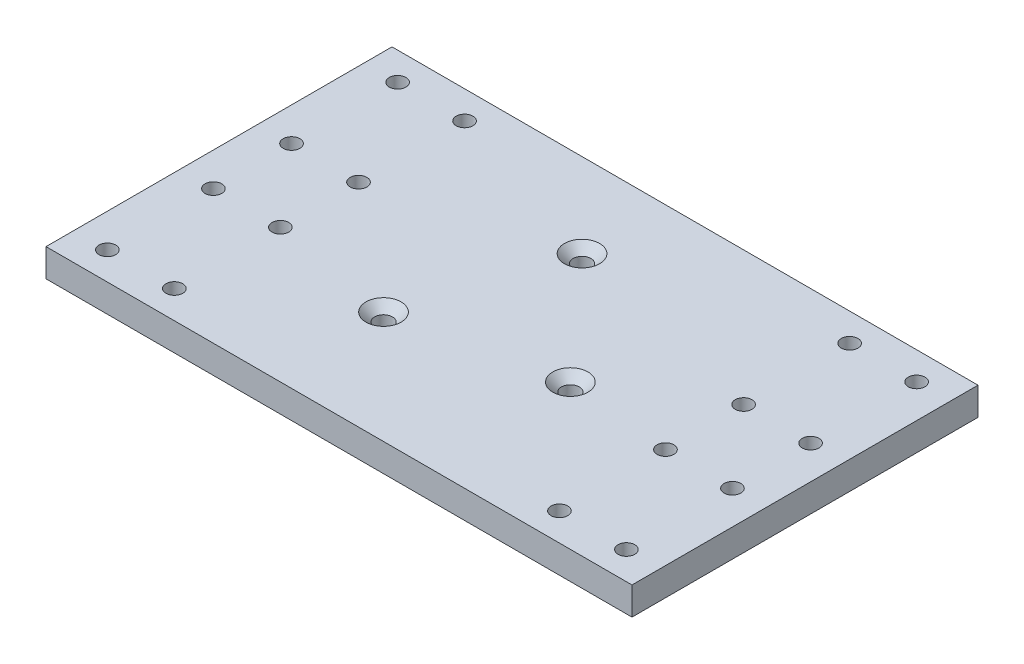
ISO-10303-21;
HEADER;
FILE_DESCRIPTION(('STEP AP214'),'2;1');
FILE_NAME('part.step','',(''),(''),'','','');
FILE_SCHEMA(('AUTOMOTIVE_DESIGN { 1 0 10303 214 1 1 1 1 }'));
ENDSEC;
DATA;
#1=APPLICATION_CONTEXT('core data for automotive mechanical design processes');
#2=APPLICATION_PROTOCOL_DEFINITION('international standard','automotive_design',2000,#1);
#3=PRODUCT_CONTEXT('',#1,'mechanical');
#4=PRODUCT('Part','Part','',(#3));
#5=PRODUCT_RELATED_PRODUCT_CATEGORY('part','',(#4));
#6=PRODUCT_DEFINITION_FORMATION('','',#4);
#7=PRODUCT_DEFINITION_CONTEXT('part definition',#1,'design');
#8=PRODUCT_DEFINITION('design','',#6,#7);
#9=PRODUCT_DEFINITION_SHAPE('','',#8);
#10=(LENGTH_UNIT() NAMED_UNIT(*) SI_UNIT(.MILLI.,.METRE.));
#11=(NAMED_UNIT(*) PLANE_ANGLE_UNIT() SI_UNIT($,.RADIAN.));
#12=(NAMED_UNIT(*) SI_UNIT($,.STERADIAN.) SOLID_ANGLE_UNIT());
#13=UNCERTAINTY_MEASURE_WITH_UNIT(LENGTH_MEASURE(1.E-05),#10,'distance_accuracy_value','');
#14=(GEOMETRIC_REPRESENTATION_CONTEXT(3) GLOBAL_UNCERTAINTY_ASSIGNED_CONTEXT((#13)) GLOBAL_UNIT_ASSIGNED_CONTEXT((#10,
#11,#12)) REPRESENTATION_CONTEXT('',''));
#15=CARTESIAN_POINT('',(0.,0.,0.));
#16=DIRECTION('',(0.,0.,1.));
#17=DIRECTION('',(1.,0.,0.));
#18=AXIS2_PLACEMENT_3D('',#15,#16,#17);
#19=CARTESIAN_POINT('',(0.,5.,0.));
#20=DIRECTION('',(0.,-1.,0.));
#21=DIRECTION('',(0.,0.,-1.));
#22=AXIS2_PLACEMENT_3D('',#19,#20,#21);
#23=PLANE('',#22);
#24=CARTESIAN_POINT('',(-12.11,5.,10.91));
#25=DIRECTION('',(0.,1.,0.));
#26=DIRECTION('',(0.,0.,1.));
#27=AXIS2_PLACEMENT_3D('',#24,#25,#26);
#28=CIRCLE('',#27,3.15);
#29=CARTESIAN_POINT('',(-12.11,5.,14.06));
#30=VERTEX_POINT('',#29);
#31=EDGE_CURVE('E655',#30,#30,#28,.T.);
#32=ORIENTED_EDGE('',*,*,#31,.F.);
#33=EDGE_LOOP('',(#32));
#34=FACE_BOUND('',#33,.T.);
#35=CARTESIAN_POINT('',(-3.39,5.,-15.94));
#36=DIRECTION('',(0.,1.,0.));
#37=DIRECTION('',(0.,0.,1.));
#38=AXIS2_PLACEMENT_3D('',#35,#36,#37);
#39=CIRCLE('',#38,3.15);
#40=CARTESIAN_POINT('',(-3.39,5.,-12.79));
#41=VERTEX_POINT('',#40);
#42=EDGE_CURVE('E130',#41,#41,#39,.T.);
#43=ORIENTED_EDGE('',*,*,#42,.F.);
#44=EDGE_LOOP('',(#43));
#45=FACE_BOUND('',#44,.T.);
#46=CARTESIAN_POINT('',(15.5,5.,5.04));
#47=DIRECTION('',(0.,1.,0.));
#48=DIRECTION('',(0.,0.,1.));
#49=AXIS2_PLACEMENT_3D('',#46,#47,#48);
#50=CIRCLE('',#49,3.15);
#51=CARTESIAN_POINT('',(15.5,5.,8.19));
#52=VERTEX_POINT('',#51);
#53=EDGE_CURVE('E123',#52,#52,#50,.T.);
#54=ORIENTED_EDGE('',*,*,#53,.F.);
#55=EDGE_LOOP('',(#54));
#56=FACE_BOUND('',#55,.T.);
#57=DIRECTION('',(0.,0.,1.));
#58=VECTOR('',#57,1.);
#59=CARTESIAN_POINT('',(-52.5,5.,31.));
#60=LINE('',#59,#58);
#61=CARTESIAN_POINT('',(-52.5,5.,-31.));
#62=VERTEX_POINT('',#61);
#63=CARTESIAN_POINT('',(-52.5,5.,31.));
#64=VERTEX_POINT('',#63);
#65=EDGE_CURVE('E95',#62,#64,#60,.T.);
#66=ORIENTED_EDGE('',*,*,#65,.T.);
#67=DIRECTION('',(1.,0.,0.));
#68=VECTOR('',#67,1.);
#69=CARTESIAN_POINT('',(-52.5,5.,31.));
#70=LINE('',#69,#68);
#71=CARTESIAN_POINT('',(52.5,5.,31.));
#72=VERTEX_POINT('',#71);
#73=EDGE_CURVE('E90',#64,#72,#70,.T.);
#74=ORIENTED_EDGE('',*,*,#73,.T.);
#75=DIRECTION('',(0.,0.,-1.));
#76=VECTOR('',#75,1.);
#77=CARTESIAN_POINT('',(52.5,5.,31.));
#78=LINE('',#77,#76);
#79=CARTESIAN_POINT('',(52.5,5.,-31.));
#80=VERTEX_POINT('',#79);
#81=EDGE_CURVE('E93',#72,#80,#78,.T.);
#82=ORIENTED_EDGE('',*,*,#81,.T.);
#83=DIRECTION('',(-1.,0.,0.));
#84=VECTOR('',#83,1.);
#85=CARTESIAN_POINT('',(-52.5,5.,-31.));
#86=LINE('',#85,#84);
#87=EDGE_CURVE('E60',#80,#62,#86,.T.);
#88=ORIENTED_EDGE('',*,*,#87,.T.);
#89=EDGE_LOOP('',(#66,#74,#82,#88));
#90=FACE_BOUND('',#89,.T.);
#91=CARTESIAN_POINT('',(46.5,5.,26.));
#92=DIRECTION('',(0.,1.,0.));
#93=DIRECTION('',(0.,0.,1.));
#94=AXIS2_PLACEMENT_3D('',#91,#92,#93);
#95=CIRCLE('',#94,1.5);
#96=CARTESIAN_POINT('',(46.5,5.,27.5));
#97=VERTEX_POINT('',#96);
#98=EDGE_CURVE('E111',#97,#97,#95,.T.);
#99=ORIENTED_EDGE('',*,*,#98,.F.);
#100=EDGE_LOOP('',(#99));
#101=FACE_BOUND('',#100,.T.);
#102=CARTESIAN_POINT('',(34.5,5.,26.));
#103=DIRECTION('',(0.,1.,0.));
#104=DIRECTION('',(0.,0.,1.));
#105=AXIS2_PLACEMENT_3D('',#102,#103,#104);
#106=CIRCLE('',#105,1.5);
#107=CARTESIAN_POINT('',(34.5,5.,27.5));
#108=VERTEX_POINT('',#107);
#109=EDGE_CURVE('E224',#108,#108,#106,.T.);
#110=ORIENTED_EDGE('',*,*,#109,.F.);
#111=EDGE_LOOP('',(#110));
#112=FACE_BOUND('',#111,.T.);
#113=CARTESIAN_POINT('',(34.5,5.,7.));
#114=DIRECTION('',(0.,1.,0.));
#115=DIRECTION('',(0.,0.,1.));
#116=AXIS2_PLACEMENT_3D('',#113,#114,#115);
#117=CIRCLE('',#116,1.5);
#118=CARTESIAN_POINT('',(34.5,5.,8.5));
#119=VERTEX_POINT('',#118);
#120=EDGE_CURVE('E218',#119,#119,#117,.T.);
#121=ORIENTED_EDGE('',*,*,#120,.F.);
#122=EDGE_LOOP('',(#121));
#123=FACE_BOUND('',#122,.T.);
#124=CARTESIAN_POINT('',(46.5,5.,7.));
#125=DIRECTION('',(0.,1.,0.));
#126=DIRECTION('',(0.,0.,1.));
#127=AXIS2_PLACEMENT_3D('',#124,#125,#126);
#128=CIRCLE('',#127,1.5);
#129=CARTESIAN_POINT('',(46.5,5.,8.5));
#130=VERTEX_POINT('',#129);
#131=EDGE_CURVE('E212',#130,#130,#128,.T.);
#132=ORIENTED_EDGE('',*,*,#131,.F.);
#133=EDGE_LOOP('',(#132));
#134=FACE_BOUND('',#133,.T.);
#135=CARTESIAN_POINT('',(-34.5,5.,26.));
#136=DIRECTION('',(0.,1.,0.));
#137=DIRECTION('',(0.,0.,-1.));
#138=AXIS2_PLACEMENT_3D('',#135,#136,#137);
#139=CIRCLE('',#138,1.5);
#140=CARTESIAN_POINT('',(-34.5,5.,24.5));
#141=VERTEX_POINT('',#140);
#142=EDGE_CURVE('E206',#141,#141,#139,.T.);
#143=ORIENTED_EDGE('',*,*,#142,.F.);
#144=EDGE_LOOP('',(#143));
#145=FACE_BOUND('',#144,.T.);
#146=CARTESIAN_POINT('',(-46.5,5.,26.));
#147=DIRECTION('',(0.,1.,0.));
#148=DIRECTION('',(0.,0.,-1.));
#149=AXIS2_PLACEMENT_3D('',#146,#147,#148);
#150=CIRCLE('',#149,1.5);
#151=CARTESIAN_POINT('',(-46.5,5.,24.5));
#152=VERTEX_POINT('',#151);
#153=EDGE_CURVE('E200',#152,#152,#150,.T.);
#154=ORIENTED_EDGE('',*,*,#153,.F.);
#155=EDGE_LOOP('',(#154));
#156=FACE_BOUND('',#155,.T.);
#157=CARTESIAN_POINT('',(-46.5,5.,7.00000000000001));
#158=DIRECTION('',(0.,1.,0.));
#159=DIRECTION('',(0.,0.,-1.));
#160=AXIS2_PLACEMENT_3D('',#157,#158,#159);
#161=CIRCLE('',#160,1.5);
#162=CARTESIAN_POINT('',(-46.5,5.,5.50000000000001));
#163=VERTEX_POINT('',#162);
#164=EDGE_CURVE('E194',#163,#163,#161,.T.);
#165=ORIENTED_EDGE('',*,*,#164,.F.);
#166=EDGE_LOOP('',(#165));
#167=FACE_BOUND('',#166,.T.);
#168=CARTESIAN_POINT('',(-34.5,5.,7.00000000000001));
#169=DIRECTION('',(0.,1.,0.));
#170=DIRECTION('',(0.,0.,-1.));
#171=AXIS2_PLACEMENT_3D('',#168,#169,#170);
#172=CIRCLE('',#171,1.5);
#173=CARTESIAN_POINT('',(-34.5,5.,5.5));
#174=VERTEX_POINT('',#173);
#175=EDGE_CURVE('E188',#174,#174,#172,.T.);
#176=ORIENTED_EDGE('',*,*,#175,.F.);
#177=EDGE_LOOP('',(#176));
#178=FACE_BOUND('',#177,.T.);
#179=CARTESIAN_POINT('',(34.5,5.,-26.));
#180=DIRECTION('',(0.,1.,0.));
#181=DIRECTION('',(0.,0.,-1.));
#182=AXIS2_PLACEMENT_3D('',#179,#180,#181);
#183=CIRCLE('',#182,1.5);
#184=CARTESIAN_POINT('',(34.5,5.,-27.5));
#185=VERTEX_POINT('',#184);
#186=EDGE_CURVE('E182',#185,#185,#183,.T.);
#187=ORIENTED_EDGE('',*,*,#186,.F.);
#188=EDGE_LOOP('',(#187));
#189=FACE_BOUND('',#188,.T.);
#190=CARTESIAN_POINT('',(46.5,5.,-26.));
#191=DIRECTION('',(0.,1.,0.));
#192=DIRECTION('',(0.,0.,-1.));
#193=AXIS2_PLACEMENT_3D('',#190,#191,#192);
#194=CIRCLE('',#193,1.5);
#195=CARTESIAN_POINT('',(46.5,5.,-27.5));
#196=VERTEX_POINT('',#195);
#197=EDGE_CURVE('E176',#196,#196,#194,.T.);
#198=ORIENTED_EDGE('',*,*,#197,.F.);
#199=EDGE_LOOP('',(#198));
#200=FACE_BOUND('',#199,.T.);
#201=CARTESIAN_POINT('',(46.5,5.,-7.));
#202=DIRECTION('',(0.,1.,0.));
#203=DIRECTION('',(0.,0.,-1.));
#204=AXIS2_PLACEMENT_3D('',#201,#202,#203);
#205=CIRCLE('',#204,1.5);
#206=CARTESIAN_POINT('',(46.5,5.,-8.5));
#207=VERTEX_POINT('',#206);
#208=EDGE_CURVE('E170',#207,#207,#205,.T.);
#209=ORIENTED_EDGE('',*,*,#208,.F.);
#210=EDGE_LOOP('',(#209));
#211=FACE_BOUND('',#210,.T.);
#212=CARTESIAN_POINT('',(34.5,5.,-7.));
#213=DIRECTION('',(0.,1.,0.));
#214=DIRECTION('',(0.,0.,-1.));
#215=AXIS2_PLACEMENT_3D('',#212,#213,#214);
#216=CIRCLE('',#215,1.5);
#217=CARTESIAN_POINT('',(34.5,5.,-8.5));
#218=VERTEX_POINT('',#217);
#219=EDGE_CURVE('E164',#218,#218,#216,.T.);
#220=ORIENTED_EDGE('',*,*,#219,.F.);
#221=EDGE_LOOP('',(#220));
#222=FACE_BOUND('',#221,.T.);
#223=CARTESIAN_POINT('',(-34.5,5.,-26.));
#224=DIRECTION('',(0.,1.,0.));
#225=DIRECTION('',(0.,0.,1.));
#226=AXIS2_PLACEMENT_3D('',#223,#224,#225);
#227=CIRCLE('',#226,1.5);
#228=CARTESIAN_POINT('',(-34.5,5.,-24.5));
#229=VERTEX_POINT('',#228);
#230=EDGE_CURVE('E158',#229,#229,#227,.T.);
#231=ORIENTED_EDGE('',*,*,#230,.F.);
#232=EDGE_LOOP('',(#231));
#233=FACE_BOUND('',#232,.T.);
#234=CARTESIAN_POINT('',(-46.5,5.,-26.));
#235=DIRECTION('',(0.,1.,0.));
#236=DIRECTION('',(0.,0.,1.));
#237=AXIS2_PLACEMENT_3D('',#234,#235,#236);
#238=CIRCLE('',#237,1.5);
#239=CARTESIAN_POINT('',(-46.5,5.,-24.5));
#240=VERTEX_POINT('',#239);
#241=EDGE_CURVE('E152',#240,#240,#238,.T.);
#242=ORIENTED_EDGE('',*,*,#241,.F.);
#243=EDGE_LOOP('',(#242));
#244=FACE_BOUND('',#243,.T.);
#245=CARTESIAN_POINT('',(-46.5,5.,-6.99999999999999));
#246=DIRECTION('',(0.,1.,0.));
#247=DIRECTION('',(0.,0.,1.));
#248=AXIS2_PLACEMENT_3D('',#245,#246,#247);
#249=CIRCLE('',#248,1.5);
#250=CARTESIAN_POINT('',(-46.5,5.,-5.49999999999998));
#251=VERTEX_POINT('',#250);
#252=EDGE_CURVE('E146',#251,#251,#249,.T.);
#253=ORIENTED_EDGE('',*,*,#252,.F.);
#254=EDGE_LOOP('',(#253));
#255=FACE_BOUND('',#254,.T.);
#256=CARTESIAN_POINT('',(-34.5,5.,-6.99999999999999));
#257=DIRECTION('',(0.,1.,0.));
#258=DIRECTION('',(0.,0.,1.));
#259=AXIS2_PLACEMENT_3D('',#256,#257,#258);
#260=CIRCLE('',#259,1.5);
#261=CARTESIAN_POINT('',(-34.5,5.,-5.49999999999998));
#262=VERTEX_POINT('',#261);
#263=EDGE_CURVE('E140',#262,#262,#260,.T.);
#264=ORIENTED_EDGE('',*,*,#263,.F.);
#265=EDGE_LOOP('',(#264));
#266=FACE_BOUND('',#265,.T.);
#267=ADVANCED_FACE('F41',(#34,#45,#56,#90,#101,#112,#123,#134,#145,#156,#167,#178,#189,#200,
#211,#222,#233,#244,#255,#266),#23,.F.);
#268=CARTESIAN_POINT('',(0.,0.,0.));
#269=DIRECTION('',(0.,-1.,0.));
#270=DIRECTION('',(0.,0.,-1.));
#271=AXIS2_PLACEMENT_3D('',#268,#269,#270);
#272=PLANE('',#271);
#273=CARTESIAN_POINT('',(-12.11,0.,10.91));
#274=DIRECTION('',(0.,-1.,0.));
#275=DIRECTION('',(0.,0.,-1.));
#276=AXIS2_PLACEMENT_3D('',#273,#274,#275);
#277=CIRCLE('',#276,1.6);
#278=CARTESIAN_POINT('',(-12.11,0.,9.31));
#279=VERTEX_POINT('',#278);
#280=EDGE_CURVE('E45',#279,#279,#277,.T.);
#281=ORIENTED_EDGE('',*,*,#280,.F.);
#282=EDGE_LOOP('',(#281));
#283=FACE_BOUND('',#282,.T.);
#284=CARTESIAN_POINT('',(-3.39,0.,-15.94));
#285=DIRECTION('',(0.,-1.,0.));
#286=DIRECTION('',(0.,0.,-1.));
#287=AXIS2_PLACEMENT_3D('',#284,#285,#286);
#288=CIRCLE('',#287,1.6);
#289=CARTESIAN_POINT('',(-3.39,0.,-17.54));
#290=VERTEX_POINT('',#289);
#291=EDGE_CURVE('E121',#290,#290,#288,.T.);
#292=ORIENTED_EDGE('',*,*,#291,.F.);
#293=EDGE_LOOP('',(#292));
#294=FACE_BOUND('',#293,.T.);
#295=CARTESIAN_POINT('',(15.5,0.,5.04));
#296=DIRECTION('',(0.,-1.,0.));
#297=DIRECTION('',(0.,0.,-1.));
#298=AXIS2_PLACEMENT_3D('',#295,#296,#297);
#299=CIRCLE('',#298,1.6);
#300=CARTESIAN_POINT('',(15.5,0.,3.44000000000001));
#301=VERTEX_POINT('',#300);
#302=EDGE_CURVE('E117',#301,#301,#299,.T.);
#303=ORIENTED_EDGE('',*,*,#302,.F.);
#304=EDGE_LOOP('',(#303));
#305=FACE_BOUND('',#304,.T.);
#306=CARTESIAN_POINT('',(-46.5,0.,-6.99999999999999));
#307=DIRECTION('',(0.,1.,0.));
#308=DIRECTION('',(0.,0.,1.));
#309=AXIS2_PLACEMENT_3D('',#306,#307,#308);
#310=CIRCLE('',#309,1.5);
#311=CARTESIAN_POINT('',(-46.5,0.,-5.49999999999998));
#312=VERTEX_POINT('',#311);
#313=EDGE_CURVE('E143',#312,#312,#310,.T.);
#314=ORIENTED_EDGE('',*,*,#313,.T.);
#315=EDGE_LOOP('',(#314));
#316=FACE_BOUND('',#315,.T.);
#317=CARTESIAN_POINT('',(-34.5,0.,-26.));
#318=DIRECTION('',(0.,1.,0.));
#319=DIRECTION('',(0.,0.,1.));
#320=AXIS2_PLACEMENT_3D('',#317,#318,#319);
#321=CIRCLE('',#320,1.5);
#322=CARTESIAN_POINT('',(-34.5,0.,-24.5));
#323=VERTEX_POINT('',#322);
#324=EDGE_CURVE('E155',#323,#323,#321,.T.);
#325=ORIENTED_EDGE('',*,*,#324,.T.);
#326=EDGE_LOOP('',(#325));
#327=FACE_BOUND('',#326,.T.);
#328=CARTESIAN_POINT('',(46.5,0.,-7.));
#329=DIRECTION('',(0.,1.,0.));
#330=DIRECTION('',(0.,0.,-1.));
#331=AXIS2_PLACEMENT_3D('',#328,#329,#330);
#332=CIRCLE('',#331,1.5);
#333=CARTESIAN_POINT('',(46.5,0.,-8.5));
#334=VERTEX_POINT('',#333);
#335=EDGE_CURVE('E167',#334,#334,#332,.T.);
#336=ORIENTED_EDGE('',*,*,#335,.T.);
#337=EDGE_LOOP('',(#336));
#338=FACE_BOUND('',#337,.T.);
#339=CARTESIAN_POINT('',(34.5,0.,-26.));
#340=DIRECTION('',(0.,1.,0.));
#341=DIRECTION('',(0.,0.,-1.));
#342=AXIS2_PLACEMENT_3D('',#339,#340,#341);
#343=CIRCLE('',#342,1.5);
#344=CARTESIAN_POINT('',(34.5,0.,-27.5));
#345=VERTEX_POINT('',#344);
#346=EDGE_CURVE('E179',#345,#345,#343,.T.);
#347=ORIENTED_EDGE('',*,*,#346,.T.);
#348=EDGE_LOOP('',(#347));
#349=FACE_BOUND('',#348,.T.);
#350=CARTESIAN_POINT('',(-46.5,0.,7.00000000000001));
#351=DIRECTION('',(0.,1.,0.));
#352=DIRECTION('',(0.,0.,-1.));
#353=AXIS2_PLACEMENT_3D('',#350,#351,#352);
#354=CIRCLE('',#353,1.5);
#355=CARTESIAN_POINT('',(-46.5,0.,5.50000000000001));
#356=VERTEX_POINT('',#355);
#357=EDGE_CURVE('E191',#356,#356,#354,.T.);
#358=ORIENTED_EDGE('',*,*,#357,.T.);
#359=EDGE_LOOP('',(#358));
#360=FACE_BOUND('',#359,.T.);
#361=CARTESIAN_POINT('',(-34.5,0.,26.));
#362=DIRECTION('',(0.,1.,0.));
#363=DIRECTION('',(0.,0.,-1.));
#364=AXIS2_PLACEMENT_3D('',#361,#362,#363);
#365=CIRCLE('',#364,1.5);
#366=CARTESIAN_POINT('',(-34.5,0.,24.5));
#367=VERTEX_POINT('',#366);
#368=EDGE_CURVE('E203',#367,#367,#365,.T.);
#369=ORIENTED_EDGE('',*,*,#368,.T.);
#370=EDGE_LOOP('',(#369));
#371=FACE_BOUND('',#370,.T.);
#372=CARTESIAN_POINT('',(34.5,0.,7.));
#373=DIRECTION('',(0.,1.,0.));
#374=DIRECTION('',(0.,0.,1.));
#375=AXIS2_PLACEMENT_3D('',#372,#373,#374);
#376=CIRCLE('',#375,1.5);
#377=CARTESIAN_POINT('',(34.5,0.,8.5));
#378=VERTEX_POINT('',#377);
#379=EDGE_CURVE('E215',#378,#378,#376,.T.);
#380=ORIENTED_EDGE('',*,*,#379,.T.);
#381=EDGE_LOOP('',(#380));
#382=FACE_BOUND('',#381,.T.);
#383=CARTESIAN_POINT('',(46.5,0.,26.));
#384=DIRECTION('',(0.,1.,0.));
#385=DIRECTION('',(0.,0.,1.));
#386=AXIS2_PLACEMENT_3D('',#383,#384,#385);
#387=CIRCLE('',#386,1.5);
#388=CARTESIAN_POINT('',(46.5,0.,27.5));
#389=VERTEX_POINT('',#388);
#390=EDGE_CURVE('E227',#389,#389,#387,.T.);
#391=ORIENTED_EDGE('',*,*,#390,.T.);
#392=EDGE_LOOP('',(#391));
#393=FACE_BOUND('',#392,.T.);
#394=DIRECTION('',(0.,0.,1.));
#395=VECTOR('',#394,1.);
#396=CARTESIAN_POINT('',(-52.5,0.,31.));
#397=LINE('',#396,#395);
#398=CARTESIAN_POINT('',(-52.5,0.,-31.));
#399=VERTEX_POINT('',#398);
#400=CARTESIAN_POINT('',(-52.5,0.,31.));
#401=VERTEX_POINT('',#400);
#402=EDGE_CURVE('E108',#399,#401,#397,.T.);
#403=ORIENTED_EDGE('',*,*,#402,.F.);
#404=DIRECTION('',(-1.,0.,0.));
#405=VECTOR('',#404,1.);
#406=CARTESIAN_POINT('',(-52.5,0.,-31.));
#407=LINE('',#406,#405);
#408=CARTESIAN_POINT('',(52.5,0.,-31.));
#409=VERTEX_POINT('',#408);
#410=EDGE_CURVE('E83',#409,#399,#407,.T.);
#411=ORIENTED_EDGE('',*,*,#410,.F.);
#412=DIRECTION('',(0.,0.,-1.));
#413=VECTOR('',#412,1.);
#414=CARTESIAN_POINT('',(52.5,0.,31.));
#415=LINE('',#414,#413);
#416=CARTESIAN_POINT('',(52.5,0.,31.));
#417=VERTEX_POINT('',#416);
#418=EDGE_CURVE('E77',#417,#409,#415,.T.);
#419=ORIENTED_EDGE('',*,*,#418,.F.);
#420=DIRECTION('',(1.,0.,0.));
#421=VECTOR('',#420,1.);
#422=CARTESIAN_POINT('',(-52.5,0.,31.));
#423=LINE('',#422,#421);
#424=EDGE_CURVE('E99',#401,#417,#423,.T.);
#425=ORIENTED_EDGE('',*,*,#424,.F.);
#426=EDGE_LOOP('',(#403,#411,#419,#425));
#427=FACE_BOUND('',#426,.T.);
#428=CARTESIAN_POINT('',(34.5,0.,26.));
#429=DIRECTION('',(0.,1.,0.));
#430=DIRECTION('',(0.,0.,1.));
#431=AXIS2_PLACEMENT_3D('',#428,#429,#430);
#432=CIRCLE('',#431,1.5);
#433=CARTESIAN_POINT('',(34.5,0.,27.5));
#434=VERTEX_POINT('',#433);
#435=EDGE_CURVE('E221',#434,#434,#432,.T.);
#436=ORIENTED_EDGE('',*,*,#435,.T.);
#437=EDGE_LOOP('',(#436));
#438=FACE_BOUND('',#437,.T.);
#439=CARTESIAN_POINT('',(46.5,0.,7.));
#440=DIRECTION('',(0.,1.,0.));
#441=DIRECTION('',(0.,0.,1.));
#442=AXIS2_PLACEMENT_3D('',#439,#440,#441);
#443=CIRCLE('',#442,1.5);
#444=CARTESIAN_POINT('',(46.5,0.,8.5));
#445=VERTEX_POINT('',#444);
#446=EDGE_CURVE('E209',#445,#445,#443,.T.);
#447=ORIENTED_EDGE('',*,*,#446,.T.);
#448=EDGE_LOOP('',(#447));
#449=FACE_BOUND('',#448,.T.);
#450=CARTESIAN_POINT('',(-46.5,0.,26.));
#451=DIRECTION('',(0.,1.,0.));
#452=DIRECTION('',(0.,0.,-1.));
#453=AXIS2_PLACEMENT_3D('',#450,#451,#452);
#454=CIRCLE('',#453,1.5);
#455=CARTESIAN_POINT('',(-46.5,0.,24.5));
#456=VERTEX_POINT('',#455);
#457=EDGE_CURVE('E197',#456,#456,#454,.T.);
#458=ORIENTED_EDGE('',*,*,#457,.T.);
#459=EDGE_LOOP('',(#458));
#460=FACE_BOUND('',#459,.T.);
#461=CARTESIAN_POINT('',(-34.5,0.,7.00000000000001));
#462=DIRECTION('',(0.,1.,0.));
#463=DIRECTION('',(0.,0.,-1.));
#464=AXIS2_PLACEMENT_3D('',#461,#462,#463);
#465=CIRCLE('',#464,1.5);
#466=CARTESIAN_POINT('',(-34.5,0.,5.5));
#467=VERTEX_POINT('',#466);
#468=EDGE_CURVE('E185',#467,#467,#465,.T.);
#469=ORIENTED_EDGE('',*,*,#468,.T.);
#470=EDGE_LOOP('',(#469));
#471=FACE_BOUND('',#470,.T.);
#472=CARTESIAN_POINT('',(46.5,0.,-26.));
#473=DIRECTION('',(0.,1.,0.));
#474=DIRECTION('',(0.,0.,-1.));
#475=AXIS2_PLACEMENT_3D('',#472,#473,#474);
#476=CIRCLE('',#475,1.5);
#477=CARTESIAN_POINT('',(46.5,0.,-27.5));
#478=VERTEX_POINT('',#477);
#479=EDGE_CURVE('E173',#478,#478,#476,.T.);
#480=ORIENTED_EDGE('',*,*,#479,.T.);
#481=EDGE_LOOP('',(#480));
#482=FACE_BOUND('',#481,.T.);
#483=CARTESIAN_POINT('',(34.5,0.,-7.));
#484=DIRECTION('',(0.,1.,0.));
#485=DIRECTION('',(0.,0.,-1.));
#486=AXIS2_PLACEMENT_3D('',#483,#484,#485);
#487=CIRCLE('',#486,1.5);
#488=CARTESIAN_POINT('',(34.5,0.,-8.5));
#489=VERTEX_POINT('',#488);
#490=EDGE_CURVE('E161',#489,#489,#487,.T.);
#491=ORIENTED_EDGE('',*,*,#490,.T.);
#492=EDGE_LOOP('',(#491));
#493=FACE_BOUND('',#492,.T.);
#494=CARTESIAN_POINT('',(-46.5,0.,-26.));
#495=DIRECTION('',(0.,1.,0.));
#496=DIRECTION('',(0.,0.,1.));
#497=AXIS2_PLACEMENT_3D('',#494,#495,#496);
#498=CIRCLE('',#497,1.5);
#499=CARTESIAN_POINT('',(-46.5,0.,-24.5));
#500=VERTEX_POINT('',#499);
#501=EDGE_CURVE('E149',#500,#500,#498,.T.);
#502=ORIENTED_EDGE('',*,*,#501,.T.);
#503=EDGE_LOOP('',(#502));
#504=FACE_BOUND('',#503,.T.);
#505=CARTESIAN_POINT('',(-34.5,0.,-6.99999999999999));
#506=DIRECTION('',(0.,1.,0.));
#507=DIRECTION('',(0.,0.,1.));
#508=AXIS2_PLACEMENT_3D('',#505,#506,#507);
#509=CIRCLE('',#508,1.5);
#510=CARTESIAN_POINT('',(-34.5,0.,-5.49999999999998));
#511=VERTEX_POINT('',#510);
#512=EDGE_CURVE('E119',#511,#511,#509,.T.);
#513=ORIENTED_EDGE('',*,*,#512,.T.);
#514=EDGE_LOOP('',(#513));
#515=FACE_BOUND('',#514,.T.);
#516=ADVANCED_FACE('F235',(#283,#294,#305,#316,#327,#338,#349,#360,#371,#382,#393,#427,#438,
#449,#460,#471,#482,#493,#504,#515),#272,.T.);
#517=CARTESIAN_POINT('',(-52.5,5.,31.));
#518=DIRECTION('',(1.,0.,0.));
#519=DIRECTION('',(0.,0.,-1.));
#520=AXIS2_PLACEMENT_3D('',#517,#518,#519);
#521=PLANE('',#520);
#522=ORIENTED_EDGE('',*,*,#402,.T.);
#523=DIRECTION('',(0.,-1.,0.));
#524=VECTOR('',#523,1.);
#525=CARTESIAN_POINT('',(-52.5,5.,31.));
#526=LINE('',#525,#524);
#527=EDGE_CURVE('E11',#64,#401,#526,.T.);
#528=ORIENTED_EDGE('',*,*,#527,.F.);
#529=ORIENTED_EDGE('',*,*,#65,.F.);
#530=DIRECTION('',(0.,-1.,0.));
#531=VECTOR('',#530,1.);
#532=CARTESIAN_POINT('',(-52.5,5.,-31.));
#533=LINE('',#532,#531);
#534=EDGE_CURVE('E104',#62,#399,#533,.T.);
#535=ORIENTED_EDGE('',*,*,#534,.T.);
#536=EDGE_LOOP('',(#522,#528,#529,#535));
#537=FACE_BOUND('',#536,.T.);
#538=ADVANCED_FACE('F43',(#537),#521,.F.);
#539=CARTESIAN_POINT('',(-52.5,5.,31.));
#540=DIRECTION('',(0.,0.,-1.));
#541=DIRECTION('',(-1.,0.,0.));
#542=AXIS2_PLACEMENT_3D('',#539,#540,#541);
#543=PLANE('',#542);
#544=ORIENTED_EDGE('',*,*,#424,.T.);
#545=DIRECTION('',(0.,-1.,0.));
#546=VECTOR('',#545,1.);
#547=CARTESIAN_POINT('',(52.5,5.,31.));
#548=LINE('',#547,#546);
#549=EDGE_CURVE('E51',#72,#417,#548,.T.);
#550=ORIENTED_EDGE('',*,*,#549,.F.);
#551=ORIENTED_EDGE('',*,*,#73,.F.);
#552=ORIENTED_EDGE('',*,*,#527,.T.);
#553=EDGE_LOOP('',(#544,#550,#551,#552));
#554=FACE_BOUND('',#553,.T.);
#555=ADVANCED_FACE('F98',(#554),#543,.F.);
#556=CARTESIAN_POINT('',(52.5,5.,31.));
#557=DIRECTION('',(-1.,0.,0.));
#558=DIRECTION('',(0.,0.,1.));
#559=AXIS2_PLACEMENT_3D('',#556,#557,#558);
#560=PLANE('',#559);
#561=ORIENTED_EDGE('',*,*,#418,.T.);
#562=DIRECTION('',(0.,-1.,0.));
#563=VECTOR('',#562,1.);
#564=CARTESIAN_POINT('',(52.5,5.,-31.));
#565=LINE('',#564,#563);
#566=EDGE_CURVE('E100',#80,#409,#565,.T.);
#567=ORIENTED_EDGE('',*,*,#566,.F.);
#568=ORIENTED_EDGE('',*,*,#81,.F.);
#569=ORIENTED_EDGE('',*,*,#549,.T.);
#570=EDGE_LOOP('',(#561,#567,#568,#569));
#571=FACE_BOUND('',#570,.T.);
#572=ADVANCED_FACE('F102',(#571),#560,.F.);
#573=CARTESIAN_POINT('',(-52.5,5.,-31.));
#574=DIRECTION('',(0.,0.,1.));
#575=DIRECTION('',(1.,0.,0.));
#576=AXIS2_PLACEMENT_3D('',#573,#574,#575);
#577=PLANE('',#576);
#578=ORIENTED_EDGE('',*,*,#410,.T.);
#579=ORIENTED_EDGE('',*,*,#534,.F.);
#580=ORIENTED_EDGE('',*,*,#87,.F.);
#581=ORIENTED_EDGE('',*,*,#566,.T.);
#582=EDGE_LOOP('',(#578,#579,#580,#581));
#583=FACE_BOUND('',#582,.T.);
#584=ADVANCED_FACE('F241',(#583),#577,.F.);
#585=CARTESIAN_POINT('',(46.5,5.,26.));
#586=DIRECTION('',(0.,-1.,0.));
#587=DIRECTION('',(0.,0.,-1.));
#588=AXIS2_PLACEMENT_3D('',#585,#586,#587);
#589=CYLINDRICAL_SURFACE('',#588,1.5);
#590=ORIENTED_EDGE('',*,*,#98,.T.);
#591=EDGE_LOOP('',(#590));
#592=FACE_BOUND('',#591,.T.);
#593=ORIENTED_EDGE('',*,*,#390,.F.);
#594=EDGE_LOOP('',(#593));
#595=FACE_BOUND('',#594,.T.);
#596=ADVANCED_FACE('F238',(#592,#595),#589,.F.);
#597=CARTESIAN_POINT('',(34.5,5.,26.));
#598=DIRECTION('',(0.,-1.,0.));
#599=DIRECTION('',(0.,0.,-1.));
#600=AXIS2_PLACEMENT_3D('',#597,#598,#599);
#601=CYLINDRICAL_SURFACE('',#600,1.5);
#602=ORIENTED_EDGE('',*,*,#109,.T.);
#603=EDGE_LOOP('',(#602));
#604=FACE_BOUND('',#603,.T.);
#605=ORIENTED_EDGE('',*,*,#435,.F.);
#606=EDGE_LOOP('',(#605));
#607=FACE_BOUND('',#606,.T.);
#608=ADVANCED_FACE('F240',(#604,#607),#601,.F.);
#609=CARTESIAN_POINT('',(34.5,5.,7.));
#610=DIRECTION('',(0.,-1.,0.));
#611=DIRECTION('',(0.,0.,-1.));
#612=AXIS2_PLACEMENT_3D('',#609,#610,#611);
#613=CYLINDRICAL_SURFACE('',#612,1.5);
#614=ORIENTED_EDGE('',*,*,#120,.T.);
#615=EDGE_LOOP('',(#614));
#616=FACE_BOUND('',#615,.T.);
#617=ORIENTED_EDGE('',*,*,#379,.F.);
#618=EDGE_LOOP('',(#617));
#619=FACE_BOUND('',#618,.T.);
#620=ADVANCED_FACE('F248',(#616,#619),#613,.F.);
#621=CARTESIAN_POINT('',(46.5,5.,7.));
#622=DIRECTION('',(0.,-1.,0.));
#623=DIRECTION('',(0.,0.,-1.));
#624=AXIS2_PLACEMENT_3D('',#621,#622,#623);
#625=CYLINDRICAL_SURFACE('',#624,1.5);
#626=ORIENTED_EDGE('',*,*,#131,.T.);
#627=EDGE_LOOP('',(#626));
#628=FACE_BOUND('',#627,.T.);
#629=ORIENTED_EDGE('',*,*,#446,.F.);
#630=EDGE_LOOP('',(#629));
#631=FACE_BOUND('',#630,.T.);
#632=ADVANCED_FACE('F347',(#628,#631),#625,.F.);
#633=CARTESIAN_POINT('',(-34.5,5.,26.));
#634=DIRECTION('',(0.,-1.,0.));
#635=DIRECTION('',(0.,0.,-1.));
#636=AXIS2_PLACEMENT_3D('',#633,#634,#635);
#637=CYLINDRICAL_SURFACE('',#636,1.5);
#638=ORIENTED_EDGE('',*,*,#142,.T.);
#639=EDGE_LOOP('',(#638));
#640=FACE_BOUND('',#639,.T.);
#641=ORIENTED_EDGE('',*,*,#368,.F.);
#642=EDGE_LOOP('',(#641));
#643=FACE_BOUND('',#642,.T.);
#644=ADVANCED_FACE('F343',(#640,#643),#637,.F.);
#645=CARTESIAN_POINT('',(-46.5,5.,26.));
#646=DIRECTION('',(0.,-1.,0.));
#647=DIRECTION('',(0.,0.,-1.));
#648=AXIS2_PLACEMENT_3D('',#645,#646,#647);
#649=CYLINDRICAL_SURFACE('',#648,1.5);
#650=ORIENTED_EDGE('',*,*,#153,.T.);
#651=EDGE_LOOP('',(#650));
#652=FACE_BOUND('',#651,.T.);
#653=ORIENTED_EDGE('',*,*,#457,.F.);
#654=EDGE_LOOP('',(#653));
#655=FACE_BOUND('',#654,.T.);
#656=ADVANCED_FACE('F339',(#652,#655),#649,.F.);
#657=CARTESIAN_POINT('',(-46.5,5.,7.00000000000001));
#658=DIRECTION('',(0.,-1.,0.));
#659=DIRECTION('',(0.,0.,-1.));
#660=AXIS2_PLACEMENT_3D('',#657,#658,#659);
#661=CYLINDRICAL_SURFACE('',#660,1.5);
#662=ORIENTED_EDGE('',*,*,#164,.T.);
#663=EDGE_LOOP('',(#662));
#664=FACE_BOUND('',#663,.T.);
#665=ORIENTED_EDGE('',*,*,#357,.F.);
#666=EDGE_LOOP('',(#665));
#667=FACE_BOUND('',#666,.T.);
#668=ADVANCED_FACE('F335',(#664,#667),#661,.F.);
#669=CARTESIAN_POINT('',(-34.5,5.,7.00000000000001));
#670=DIRECTION('',(0.,-1.,0.));
#671=DIRECTION('',(0.,0.,-1.));
#672=AXIS2_PLACEMENT_3D('',#669,#670,#671);
#673=CYLINDRICAL_SURFACE('',#672,1.5);
#674=ORIENTED_EDGE('',*,*,#175,.T.);
#675=EDGE_LOOP('',(#674));
#676=FACE_BOUND('',#675,.T.);
#677=ORIENTED_EDGE('',*,*,#468,.F.);
#678=EDGE_LOOP('',(#677));
#679=FACE_BOUND('',#678,.T.);
#680=ADVANCED_FACE('F331',(#676,#679),#673,.F.);
#681=CARTESIAN_POINT('',(34.5,5.,-26.));
#682=DIRECTION('',(0.,-1.,0.));
#683=DIRECTION('',(0.,0.,-1.));
#684=AXIS2_PLACEMENT_3D('',#681,#682,#683);
#685=CYLINDRICAL_SURFACE('',#684,1.5);
#686=ORIENTED_EDGE('',*,*,#186,.T.);
#687=EDGE_LOOP('',(#686));
#688=FACE_BOUND('',#687,.T.);
#689=ORIENTED_EDGE('',*,*,#346,.F.);
#690=EDGE_LOOP('',(#689));
#691=FACE_BOUND('',#690,.T.);
#692=ADVANCED_FACE('F327',(#688,#691),#685,.F.);
#693=CARTESIAN_POINT('',(46.5,5.,-26.));
#694=DIRECTION('',(0.,-1.,0.));
#695=DIRECTION('',(0.,0.,-1.));
#696=AXIS2_PLACEMENT_3D('',#693,#694,#695);
#697=CYLINDRICAL_SURFACE('',#696,1.5);
#698=ORIENTED_EDGE('',*,*,#197,.T.);
#699=EDGE_LOOP('',(#698));
#700=FACE_BOUND('',#699,.T.);
#701=ORIENTED_EDGE('',*,*,#479,.F.);
#702=EDGE_LOOP('',(#701));
#703=FACE_BOUND('',#702,.T.);
#704=ADVANCED_FACE('F323',(#700,#703),#697,.F.);
#705=CARTESIAN_POINT('',(46.5,5.,-7.));
#706=DIRECTION('',(0.,-1.,0.));
#707=DIRECTION('',(0.,0.,-1.));
#708=AXIS2_PLACEMENT_3D('',#705,#706,#707);
#709=CYLINDRICAL_SURFACE('',#708,1.5);
#710=ORIENTED_EDGE('',*,*,#208,.T.);
#711=EDGE_LOOP('',(#710));
#712=FACE_BOUND('',#711,.T.);
#713=ORIENTED_EDGE('',*,*,#335,.F.);
#714=EDGE_LOOP('',(#713));
#715=FACE_BOUND('',#714,.T.);
#716=ADVANCED_FACE('F319',(#712,#715),#709,.F.);
#717=CARTESIAN_POINT('',(34.5,5.,-7.));
#718=DIRECTION('',(0.,-1.,0.));
#719=DIRECTION('',(0.,0.,-1.));
#720=AXIS2_PLACEMENT_3D('',#717,#718,#719);
#721=CYLINDRICAL_SURFACE('',#720,1.5);
#722=ORIENTED_EDGE('',*,*,#219,.T.);
#723=EDGE_LOOP('',(#722));
#724=FACE_BOUND('',#723,.T.);
#725=ORIENTED_EDGE('',*,*,#490,.F.);
#726=EDGE_LOOP('',(#725));
#727=FACE_BOUND('',#726,.T.);
#728=ADVANCED_FACE('F315',(#724,#727),#721,.F.);
#729=CARTESIAN_POINT('',(-34.5,5.,-26.));
#730=DIRECTION('',(0.,-1.,0.));
#731=DIRECTION('',(0.,0.,-1.));
#732=AXIS2_PLACEMENT_3D('',#729,#730,#731);
#733=CYLINDRICAL_SURFACE('',#732,1.5);
#734=ORIENTED_EDGE('',*,*,#230,.T.);
#735=EDGE_LOOP('',(#734));
#736=FACE_BOUND('',#735,.T.);
#737=ORIENTED_EDGE('',*,*,#324,.F.);
#738=EDGE_LOOP('',(#737));
#739=FACE_BOUND('',#738,.T.);
#740=ADVANCED_FACE('F311',(#736,#739),#733,.F.);
#741=CARTESIAN_POINT('',(-46.5,5.,-26.));
#742=DIRECTION('',(0.,-1.,0.));
#743=DIRECTION('',(0.,0.,-1.));
#744=AXIS2_PLACEMENT_3D('',#741,#742,#743);
#745=CYLINDRICAL_SURFACE('',#744,1.5);
#746=ORIENTED_EDGE('',*,*,#241,.T.);
#747=EDGE_LOOP('',(#746));
#748=FACE_BOUND('',#747,.T.);
#749=ORIENTED_EDGE('',*,*,#501,.F.);
#750=EDGE_LOOP('',(#749));
#751=FACE_BOUND('',#750,.T.);
#752=ADVANCED_FACE('F304',(#748,#751),#745,.F.);
#753=CARTESIAN_POINT('',(-46.5,5.,-6.99999999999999));
#754=DIRECTION('',(0.,-1.,0.));
#755=DIRECTION('',(0.,0.,-1.));
#756=AXIS2_PLACEMENT_3D('',#753,#754,#755);
#757=CYLINDRICAL_SURFACE('',#756,1.5);
#758=ORIENTED_EDGE('',*,*,#252,.T.);
#759=EDGE_LOOP('',(#758));
#760=FACE_BOUND('',#759,.T.);
#761=ORIENTED_EDGE('',*,*,#313,.F.);
#762=EDGE_LOOP('',(#761));
#763=FACE_BOUND('',#762,.T.);
#764=ADVANCED_FACE('F294',(#760,#763),#757,.F.);
#765=CARTESIAN_POINT('',(-34.5,5.,-6.99999999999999));
#766=DIRECTION('',(0.,-1.,0.));
#767=DIRECTION('',(0.,0.,-1.));
#768=AXIS2_PLACEMENT_3D('',#765,#766,#767);
#769=CYLINDRICAL_SURFACE('',#768,1.5);
#770=ORIENTED_EDGE('',*,*,#263,.T.);
#771=EDGE_LOOP('',(#770));
#772=FACE_BOUND('',#771,.T.);
#773=ORIENTED_EDGE('',*,*,#512,.F.);
#774=EDGE_LOOP('',(#773));
#775=FACE_BOUND('',#774,.T.);
#776=ADVANCED_FACE('F291',(#772,#775),#769,.F.);
#777=CARTESIAN_POINT('',(15.5,5.,5.04));
#778=DIRECTION('',(0.,1.,0.));
#779=DIRECTION('',(0.,0.,1.));
#780=AXIS2_PLACEMENT_3D('',#777,#778,#779);
#781=CYLINDRICAL_SURFACE('',#780,1.6);
#782=ORIENTED_EDGE('',*,*,#302,.T.);
#783=EDGE_LOOP('',(#782));
#784=FACE_BOUND('',#783,.T.);
#785=CARTESIAN_POINT('',(15.5,3.45,5.04));
#786=DIRECTION('',(0.,1.,0.));
#787=DIRECTION('',(0.,0.,1.));
#788=AXIS2_PLACEMENT_3D('',#785,#786,#787);
#789=CIRCLE('',#788,1.6);
#790=CARTESIAN_POINT('',(15.5,3.45,6.64));
#791=VERTEX_POINT('',#790);
#792=EDGE_CURVE('E120',#791,#791,#789,.T.);
#793=ORIENTED_EDGE('',*,*,#792,.T.);
#794=EDGE_LOOP('',(#793));
#795=FACE_BOUND('',#794,.T.);
#796=ADVANCED_FACE('F293',(#784,#795),#781,.F.);
#797=CARTESIAN_POINT('',(15.5,5.,5.04));
#798=DIRECTION('',(0.,1.,0.));
#799=DIRECTION('',(0.,0.,1.));
#800=AXIS2_PLACEMENT_3D('',#797,#798,#799);
#801=CONICAL_SURFACE('',#800,3.15,0.785398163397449);
#802=ORIENTED_EDGE('',*,*,#792,.F.);
#803=EDGE_LOOP('',(#802));
#804=FACE_BOUND('',#803,.T.);
#805=ORIENTED_EDGE('',*,*,#53,.T.);
#806=EDGE_LOOP('',(#805));
#807=FACE_BOUND('',#806,.T.);
#808=ADVANCED_FACE('F301',(#804,#807),#801,.F.);
#809=CARTESIAN_POINT('',(-3.39,5.,-15.94));
#810=DIRECTION('',(0.,1.,0.));
#811=DIRECTION('',(0.,0.,1.));
#812=AXIS2_PLACEMENT_3D('',#809,#810,#811);
#813=CYLINDRICAL_SURFACE('',#812,1.6);
#814=ORIENTED_EDGE('',*,*,#291,.T.);
#815=EDGE_LOOP('',(#814));
#816=FACE_BOUND('',#815,.T.);
#817=CARTESIAN_POINT('',(-3.39,3.45,-15.94));
#818=DIRECTION('',(0.,1.,0.));
#819=DIRECTION('',(0.,0.,1.));
#820=AXIS2_PLACEMENT_3D('',#817,#818,#819);
#821=CIRCLE('',#820,1.6);
#822=CARTESIAN_POINT('',(-3.39,3.45,-14.34));
#823=VERTEX_POINT('',#822);
#824=EDGE_CURVE('E124',#823,#823,#821,.T.);
#825=ORIENTED_EDGE('',*,*,#824,.T.);
#826=EDGE_LOOP('',(#825));
#827=FACE_BOUND('',#826,.T.);
#828=ADVANCED_FACE('F479',(#816,#827),#813,.F.);
#829=CARTESIAN_POINT('',(-3.39,5.,-15.94));
#830=DIRECTION('',(0.,1.,0.));
#831=DIRECTION('',(0.,0.,1.));
#832=AXIS2_PLACEMENT_3D('',#829,#830,#831);
#833=CONICAL_SURFACE('',#832,3.15,0.785398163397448);
#834=ORIENTED_EDGE('',*,*,#824,.F.);
#835=EDGE_LOOP('',(#834));
#836=FACE_BOUND('',#835,.T.);
#837=ORIENTED_EDGE('',*,*,#42,.T.);
#838=EDGE_LOOP('',(#837));
#839=FACE_BOUND('',#838,.T.);
#840=ADVANCED_FACE('F488',(#836,#839),#833,.F.);
#841=CARTESIAN_POINT('',(-12.11,5.,10.91));
#842=DIRECTION('',(0.,1.,0.));
#843=DIRECTION('',(0.,0.,1.));
#844=AXIS2_PLACEMENT_3D('',#841,#842,#843);
#845=CYLINDRICAL_SURFACE('',#844,1.6);
#846=ORIENTED_EDGE('',*,*,#280,.T.);
#847=EDGE_LOOP('',(#846));
#848=FACE_BOUND('',#847,.T.);
#849=CARTESIAN_POINT('',(-12.11,3.45,10.91));
#850=DIRECTION('',(0.,1.,0.));
#851=DIRECTION('',(0.,0.,1.));
#852=AXIS2_PLACEMENT_3D('',#849,#850,#851);
#853=CIRCLE('',#852,1.6);
#854=CARTESIAN_POINT('',(-12.11,3.45,12.51));
#855=VERTEX_POINT('',#854);
#856=EDGE_CURVE('E653',#855,#855,#853,.T.);
#857=ORIENTED_EDGE('',*,*,#856,.T.);
#858=EDGE_LOOP('',(#857));
#859=FACE_BOUND('',#858,.T.);
#860=ADVANCED_FACE('F497',(#848,#859),#845,.F.);
#861=CARTESIAN_POINT('',(-12.11,5.,10.91));
#862=DIRECTION('',(0.,1.,0.));
#863=DIRECTION('',(0.,0.,1.));
#864=AXIS2_PLACEMENT_3D('',#861,#862,#863);
#865=CONICAL_SURFACE('',#864,3.15,0.785398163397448);
#866=ORIENTED_EDGE('',*,*,#856,.F.);
#867=EDGE_LOOP('',(#866));
#868=FACE_BOUND('',#867,.T.);
#869=ORIENTED_EDGE('',*,*,#31,.T.);
#870=EDGE_LOOP('',(#869));
#871=FACE_BOUND('',#870,.T.);
#872=ADVANCED_FACE('F507',(#868,#871),#865,.F.);
#873=CLOSED_SHELL('',(#267,#516,#538,#555,#572,#584,#596,#608,#620,#632,#644,#656,#668,#680,
#692,#704,#716,#728,#740,#752,#764,#776,#796,#808,#828,#840,#860,#872));
#874=MANIFOLD_SOLID_BREP('B2',#873);
#875=ADVANCED_BREP_SHAPE_REPRESENTATION('',(#18,#874),#14);
#876=SHAPE_DEFINITION_REPRESENTATION(#9,#875);
ENDSEC;
END-ISO-10303-21;
